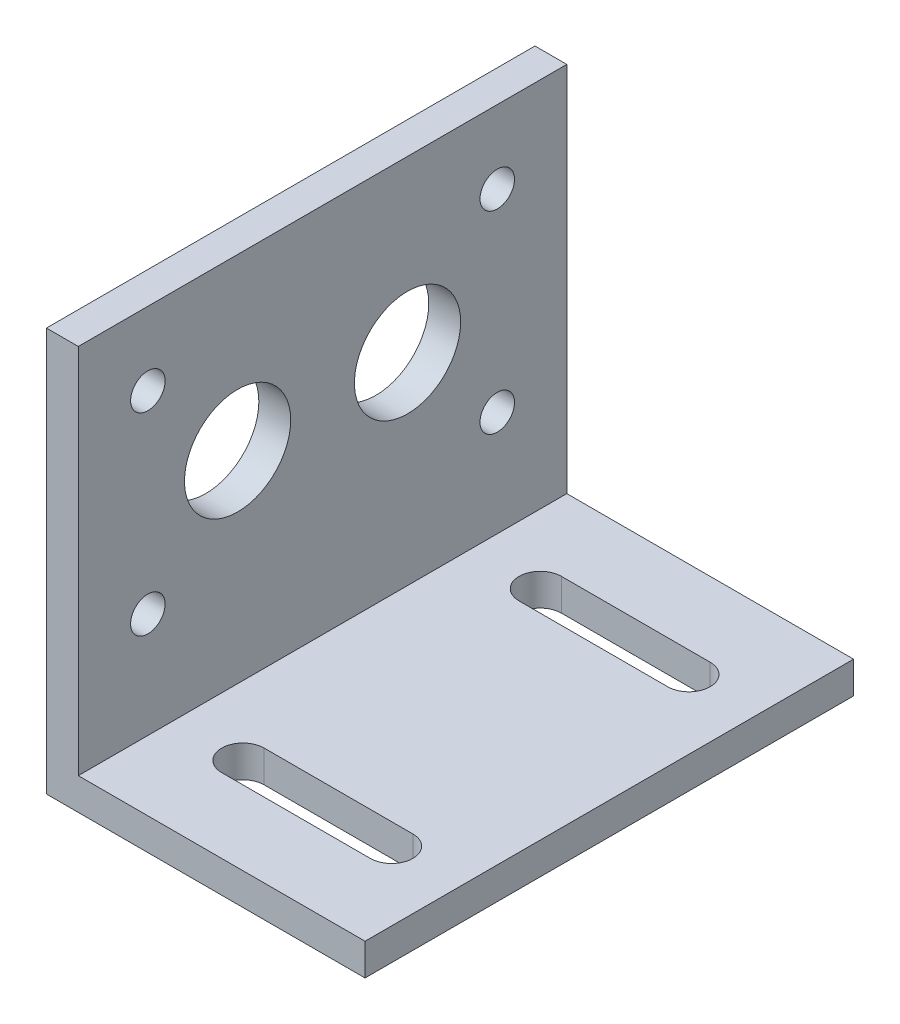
from build123d import *

# Parameters (mm, degrees)
BOSS_EXTRUDE1_DEPTH = 23
CUT_EXTRUDE1_DEPTH  = 52.51698749
SKETCH3_R           = 1.625
SKETCH3_R_2         = 5
CUT_EXTRUDE2_DEPTH  = 52.980765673


with BuildPart() as part:
    # Sketch1 → Boss-Extrude1 (new, symmetric)
    with BuildSketch(Plane.XY):
        Polygon((0, 0), (-30, 0), (-30, 38), (-27, 38), (-27, 3), (0, 3), align=None)
    extrude(amount=BOSS_EXTRUDE1_DEPTH, both=True)

    # Sketch2 → Cut-Extrude1 (cut, through all)
    with BuildSketch(Plane(origin=(0, 3, 0), x_dir=(1, 0, 0), z_dir=(0, 1, 0))):
        with BuildLine():
            Line((-6.5, -16), (-20.5, -16))
            ThreePointArc((-20.5, -16), (-22.5, -14), (-20.5, -12))
            Line((-20.5, -12), (-6.5, -12))
            ThreePointArc((-6.5, -12), (-4.5, -14), (-6.5, -16))
        make_face()
        with BuildLine():
            Line((-6.5, 16), (-20.5, 16))
            ThreePointArc((-20.5, 16), (-22.5, 14), (-20.5, 12))
            Line((-20.5, 12), (-6.5, 12))
            ThreePointArc((-6.5, 12), (-4.5, 14), (-6.5, 16))
        make_face()
    extrude(amount=-CUT_EXTRUDE1_DEPTH, mode=Mode.SUBTRACT)

    # Sketch3 → Cut-Extrude2 (cut, through all)
    with BuildSketch(Plane(origin=(-27, 0, 0), x_dir=(0, 0, -1), z_dir=(1, 0, 0))):
        with Locations((-16.45, 31.11)):
            Circle(SKETCH3_R)
        with Locations((-8, 22)):
            Circle(SKETCH3_R_2)
        with Locations((-16.45, 12.91)):
            Circle(SKETCH3_R)
        with Locations((8, 22)):
            Circle(SKETCH3_R_2)
        with Locations((16.45, 31.11)):
            Circle(SKETCH3_R)
        with Locations((16.45, 12.91)):
            Circle(SKETCH3_R)
    extrude(amount=-CUT_EXTRUDE2_DEPTH, mode=Mode.SUBTRACT)


solid = part.part
